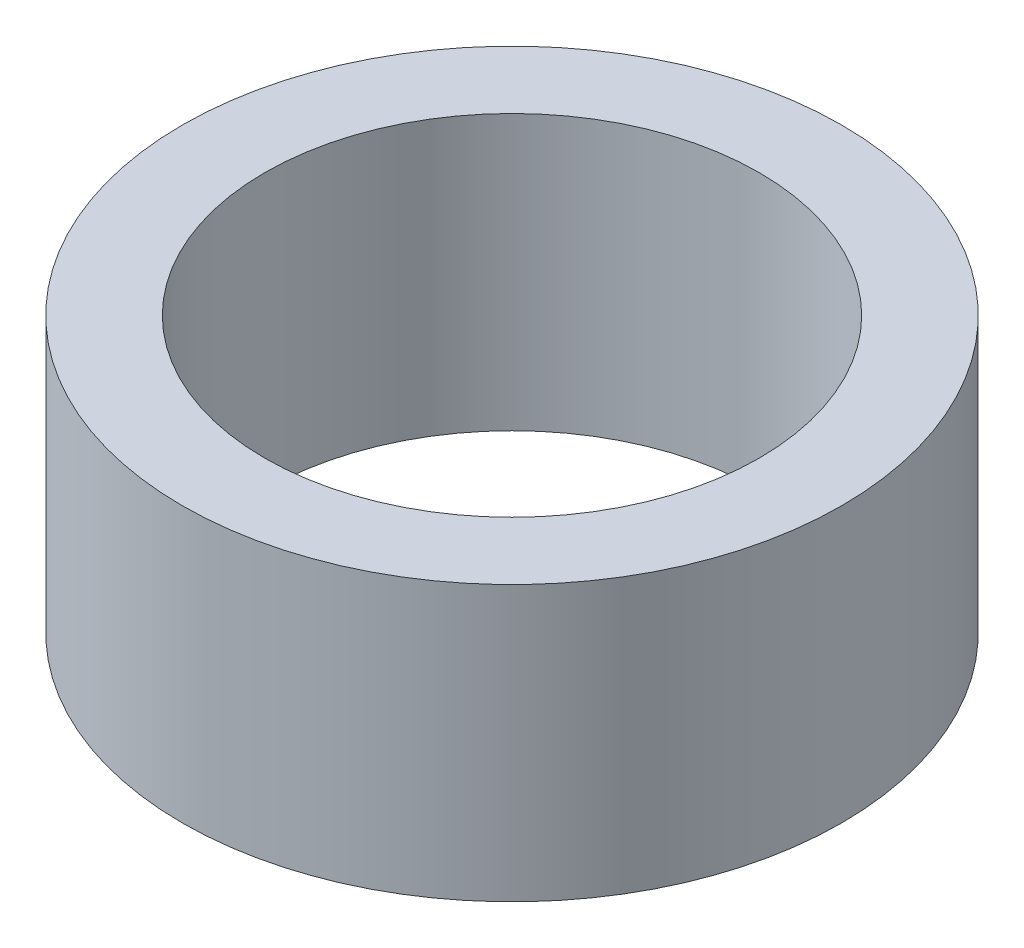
from build123d import *

# Parameters (mm, degrees)
ESQUISSE1_W = 1.5
ESQUISSE1_H = 5


with BuildPart() as part:
    # Esquisse1 → R_volution1 (revolve)
    with BuildSketch(Plane.XY, mode=Mode.PRIVATE) as r_volution1_sk:
        with Locations((5.25, 2.5)):
            Rectangle(ESQUISSE1_W, ESQUISSE1_H)
    revolve(r_volution1_sk.sketch.rotate(Axis((0, 0, 0), (0, 1, 0)), 90), axis=Axis((0, 0, 0), (0, 1, 0)))


solid = part.part
